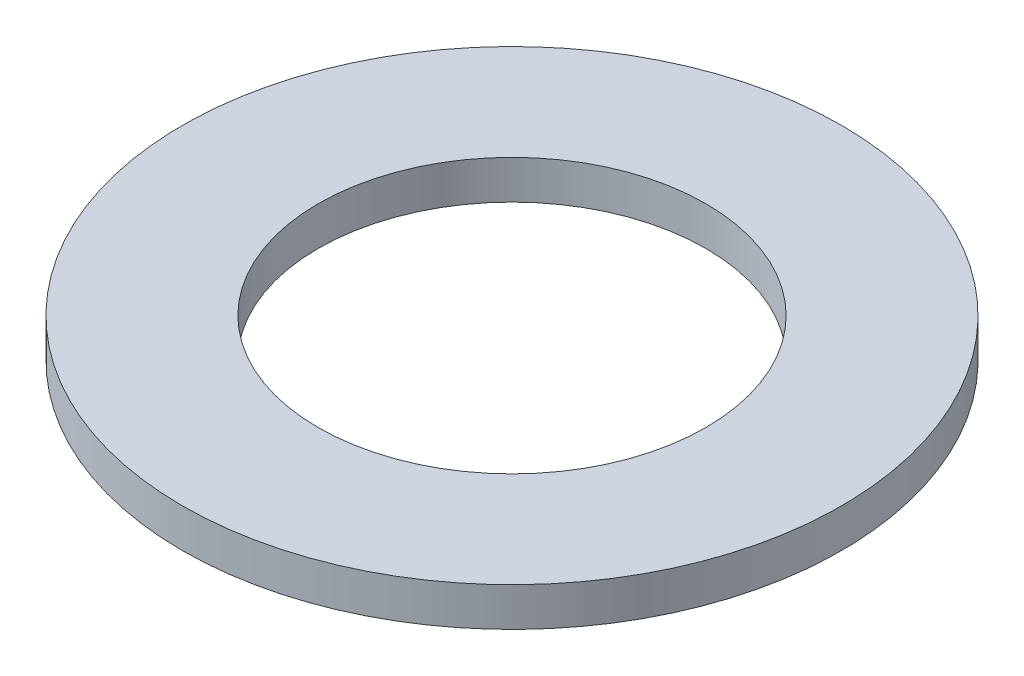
from build123d import *

# Parameters (mm, degrees)
ESQUISSE1_R      = 8.5
ESQUISSE1_R_2    = 5
EXTRUSION1_DEPTH = 1


with BuildPart() as part:
    # Esquisse1 → Extrusion1 (new body)
    with BuildSketch(Plane(origin=(0, 0, 0), x_dir=(1, 0, 0), z_dir=(0, 1, 0))):
        with Locations(Location((0, 0, 0), (0, 0, 270))):
            Circle(ESQUISSE1_R)
        with Locations(Location((0, 0, 0), (0, 0, 270))):
            Circle(ESQUISSE1_R_2, mode=Mode.SUBTRACT)
    extrude(amount=EXTRUSION1_DEPTH)


solid = part.part
